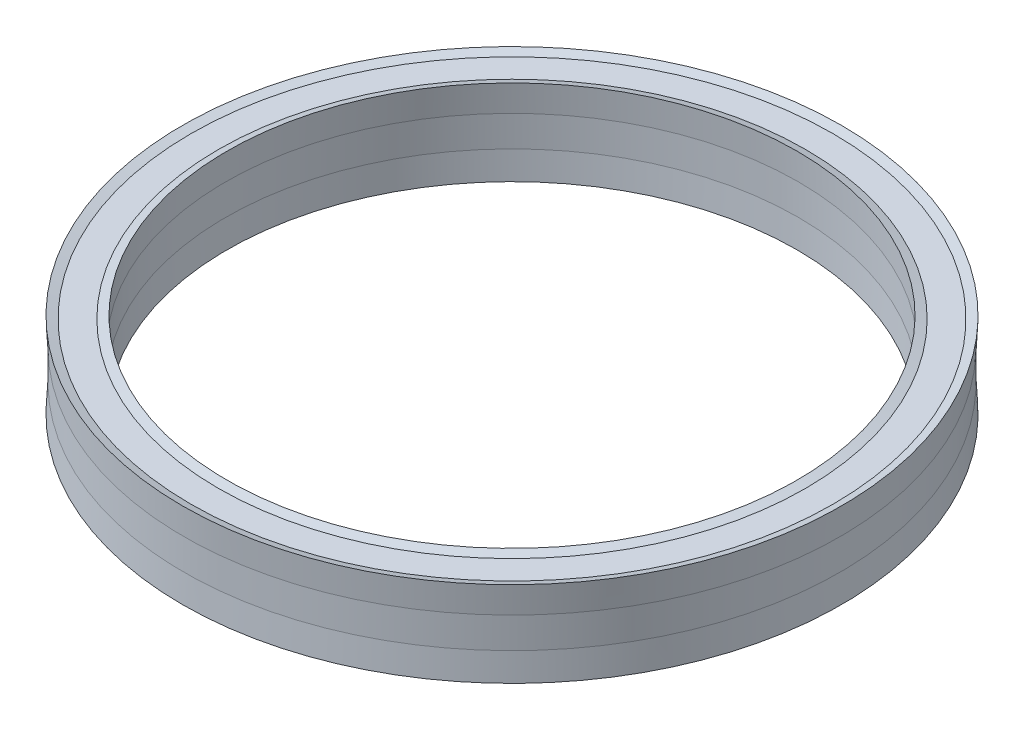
from build123d import *


with BuildPart() as part:
    # Sketch1 → Revolve1 (revolve)
    with BuildSketch(Plane.XY, mode=Mode.PRIVATE) as revolve1_sk:
        Polygon((12.7, 3.81), (12.7635, 2.5908), (12.7635, 1.2192), (12.7, 0), (13.081, 0.127), (14.303375, 0.127), (14.684375, 0), (14.620875, 1.2192), (14.620875, 2.5908), (14.684375, 3.81), (14.303375, 3.683), (13.081, 3.683), align=None)
    revolve(revolve1_sk.sketch.rotate(Axis((0, 0, 0), (0, 1, 0)), 90), axis=Axis((0, 0, 0), (0, 1, 0)))


solid = part.part
